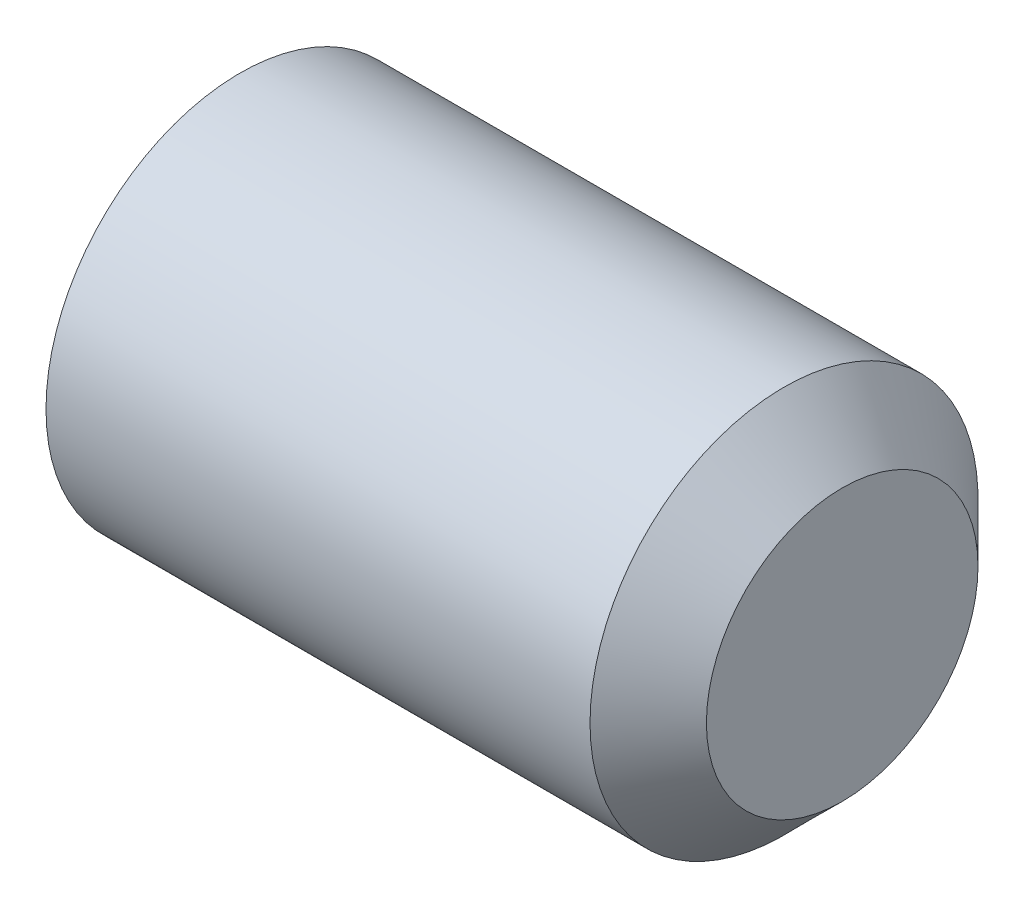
ISO-10303-21;
HEADER;
FILE_DESCRIPTION(('STEP AP214'),'2;1');
FILE_NAME('part.step','',(''),(''),'','','');
FILE_SCHEMA(('AUTOMOTIVE_DESIGN { 1 0 10303 214 1 1 1 1 }'));
ENDSEC;
DATA;
#1=APPLICATION_CONTEXT('core data for automotive mechanical design processes');
#2=APPLICATION_PROTOCOL_DEFINITION('international standard','automotive_design',2000,#1);
#3=PRODUCT_CONTEXT('',#1,'mechanical');
#4=PRODUCT('Part','Part','',(#3));
#5=PRODUCT_RELATED_PRODUCT_CATEGORY('part','',(#4));
#6=PRODUCT_DEFINITION_FORMATION('','',#4);
#7=PRODUCT_DEFINITION_CONTEXT('part definition',#1,'design');
#8=PRODUCT_DEFINITION('design','',#6,#7);
#9=PRODUCT_DEFINITION_SHAPE('','',#8);
#10=(LENGTH_UNIT() NAMED_UNIT(*) SI_UNIT(.MILLI.,.METRE.));
#11=(NAMED_UNIT(*) PLANE_ANGLE_UNIT() SI_UNIT($,.RADIAN.));
#12=(NAMED_UNIT(*) SI_UNIT($,.STERADIAN.) SOLID_ANGLE_UNIT());
#13=UNCERTAINTY_MEASURE_WITH_UNIT(LENGTH_MEASURE(1.E-05),#10,'distance_accuracy_value','');
#14=(GEOMETRIC_REPRESENTATION_CONTEXT(3) GLOBAL_UNCERTAINTY_ASSIGNED_CONTEXT((#13)) GLOBAL_UNIT_ASSIGNED_CONTEXT((#10,
#11,#12)) REPRESENTATION_CONTEXT('',''));
#15=CARTESIAN_POINT('',(0.,0.,0.));
#16=DIRECTION('',(0.,0.,1.));
#17=DIRECTION('',(1.,0.,0.));
#18=AXIS2_PLACEMENT_3D('',#15,#16,#17);
#19=CARTESIAN_POINT('',(0.,0.,0.));
#20=DIRECTION('',(-1.,0.,0.));
#21=DIRECTION('',(0.,0.,1.));
#22=AXIS2_PLACEMENT_3D('',#19,#20,#21);
#23=PLANE('',#22);
#24=CARTESIAN_POINT('',(0.,0.,0.));
#25=DIRECTION('',(-1.,0.,0.));
#26=DIRECTION('',(0.,0.,1.));
#27=AXIS2_PLACEMENT_3D('',#24,#25,#26);
#28=CIRCLE('',#27,4.172);
#29=CARTESIAN_POINT('',(0.,0.,4.172));
#30=VERTEX_POINT('',#29);
#31=EDGE_CURVE('E135',#30,#30,#28,.T.);
#32=ORIENTED_EDGE('',*,*,#31,.T.);
#33=EDGE_LOOP('',(#32));
#34=FACE_BOUND('',#33,.T.);
#35=DIRECTION('',(0.,0.,-1.));
#36=VECTOR('',#35,1.);
#37=CARTESIAN_POINT('',(0.,2.5,1.44337567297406));
#38=LINE('',#37,#36);
#39=CARTESIAN_POINT('',(0.,2.5,1.44337567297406));
#40=VERTEX_POINT('',#39);
#41=CARTESIAN_POINT('',(0.,2.5,-1.44337567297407));
#42=VERTEX_POINT('',#41);
#43=EDGE_CURVE('E126',#40,#42,#38,.T.);
#44=ORIENTED_EDGE('',*,*,#43,.F.);
#45=DIRECTION('',(0.,-0.866025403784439,0.5));
#46=VECTOR('',#45,1.);
#47=CARTESIAN_POINT('',(0.,2.5,1.44337567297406));
#48=LINE('',#47,#46);
#49=CARTESIAN_POINT('',(0.,0.,2.88675134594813));
#50=VERTEX_POINT('',#49);
#51=EDGE_CURVE('E48',#40,#50,#48,.T.);
#52=ORIENTED_EDGE('',*,*,#51,.T.);
#53=DIRECTION('',(0.,0.866025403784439,0.5));
#54=VECTOR('',#53,1.);
#55=CARTESIAN_POINT('',(0.,-2.5,1.44337567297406));
#56=LINE('',#55,#54);
#57=CARTESIAN_POINT('',(0.,-2.5,1.44337567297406));
#58=VERTEX_POINT('',#57);
#59=EDGE_CURVE('E117',#58,#50,#56,.T.);
#60=ORIENTED_EDGE('',*,*,#59,.F.);
#61=DIRECTION('',(0.,0.,-1.));
#62=VECTOR('',#61,1.);
#63=CARTESIAN_POINT('',(0.,-2.5,1.44337567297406));
#64=LINE('',#63,#62);
#65=CARTESIAN_POINT('',(0.,-2.5,-1.44337567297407));
#66=VERTEX_POINT('',#65);
#67=EDGE_CURVE('E120',#58,#66,#64,.T.);
#68=ORIENTED_EDGE('',*,*,#67,.T.);
#69=DIRECTION('',(0.,0.866025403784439,-0.5));
#70=VECTOR('',#69,1.);
#71=CARTESIAN_POINT('',(0.,-2.5,-1.44337567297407));
#72=LINE('',#71,#70);
#73=CARTESIAN_POINT('',(0.,0.,-2.88675134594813));
#74=VERTEX_POINT('',#73);
#75=EDGE_CURVE('E123',#66,#74,#72,.T.);
#76=ORIENTED_EDGE('',*,*,#75,.T.);
#77=DIRECTION('',(0.,-0.866025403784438,-0.5));
#78=VECTOR('',#77,1.);
#79=CARTESIAN_POINT('',(0.,2.5,-1.44337567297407));
#80=LINE('',#79,#78);
#81=EDGE_CURVE('E106',#42,#74,#80,.T.);
#82=ORIENTED_EDGE('',*,*,#81,.F.);
#83=EDGE_LOOP('',(#44,#52,#60,#68,#76,#82));
#84=FACE_BOUND('',#83,.T.);
#85=ADVANCED_FACE('F33',(#34,#84),#23,.T.);
#86=CARTESIAN_POINT('',(16.,3.5,0.));
#87=DIRECTION('',(1.,0.,0.));
#88=DIRECTION('',(0.,0.,-1.));
#89=AXIS2_PLACEMENT_3D('',#86,#87,#88);
#90=PLANE('',#89);
#91=CARTESIAN_POINT('',(16.,0.,0.));
#92=DIRECTION('',(-1.,0.,0.));
#93=DIRECTION('',(0.,0.,1.));
#94=AXIS2_PLACEMENT_3D('',#91,#92,#93);
#95=CIRCLE('',#94,3.5);
#96=CARTESIAN_POINT('',(16.,0.,3.5));
#97=VERTEX_POINT('',#96);
#98=EDGE_CURVE('E11',#97,#97,#95,.T.);
#99=ORIENTED_EDGE('',*,*,#98,.F.);
#100=EDGE_LOOP('',(#99));
#101=FACE_BOUND('',#100,.T.);
#102=ADVANCED_FACE('F35',(#101),#90,.T.);
#103=CARTESIAN_POINT('',(14.5,0.,0.));
#104=DIRECTION('',(-1.,0.,0.));
#105=DIRECTION('',(0.,0.,1.));
#106=AXIS2_PLACEMENT_3D('',#103,#104,#105);
#107=CONICAL_SURFACE('',#106,5.,0.785398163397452);
#108=ORIENTED_EDGE('',*,*,#98,.T.);
#109=EDGE_LOOP('',(#108));
#110=FACE_BOUND('',#109,.T.);
#111=CARTESIAN_POINT('',(14.5,0.,0.));
#112=DIRECTION('',(-1.,0.,0.));
#113=DIRECTION('',(0.,0.,1.));
#114=AXIS2_PLACEMENT_3D('',#111,#112,#113);
#115=CIRCLE('',#114,5.);
#116=CARTESIAN_POINT('',(14.5,0.,5.));
#117=VERTEX_POINT('',#116);
#118=EDGE_CURVE('E41',#117,#117,#115,.T.);
#119=ORIENTED_EDGE('',*,*,#118,.F.);
#120=EDGE_LOOP('',(#119));
#121=FACE_BOUND('',#120,.T.);
#122=ADVANCED_FACE('F146',(#110,#121),#107,.T.);
#123=CARTESIAN_POINT('',(-12.7,0.,0.));
#124=DIRECTION('',(-1.,0.,0.));
#125=DIRECTION('',(0.,0.,1.));
#126=AXIS2_PLACEMENT_3D('',#123,#124,#125);
#127=CYLINDRICAL_SURFACE('',#126,5.);
#128=ORIENTED_EDGE('',*,*,#118,.T.);
#129=EDGE_LOOP('',(#128));
#130=FACE_BOUND('',#129,.T.);
#131=CARTESIAN_POINT('',(0.478046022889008,0.,0.));
#132=DIRECTION('',(-1.,0.,0.));
#133=DIRECTION('',(0.,0.,1.));
#134=AXIS2_PLACEMENT_3D('',#131,#132,#133);
#135=CIRCLE('',#134,5.);
#136=CARTESIAN_POINT('',(0.478046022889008,0.,5.));
#137=VERTEX_POINT('',#136);
#138=EDGE_CURVE('E138',#137,#137,#135,.T.);
#139=ORIENTED_EDGE('',*,*,#138,.F.);
#140=EDGE_LOOP('',(#139));
#141=FACE_BOUND('',#140,.T.);
#142=ADVANCED_FACE('F143',(#130,#141),#127,.T.);
#143=CARTESIAN_POINT('',(0.,0.,0.));
#144=DIRECTION('',(1.,0.,0.));
#145=DIRECTION('',(0.,0.,-1.));
#146=AXIS2_PLACEMENT_3D('',#143,#144,#145);
#147=CONICAL_SURFACE('',#146,4.172,1.0471975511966);
#148=ORIENTED_EDGE('',*,*,#138,.T.);
#149=EDGE_LOOP('',(#148));
#150=FACE_BOUND('',#149,.T.);
#151=ORIENTED_EDGE('',*,*,#31,.F.);
#152=EDGE_LOOP('',(#151));
#153=FACE_BOUND('',#152,.T.);
#154=ADVANCED_FACE('F153',(#150,#153),#147,.T.);
#155=CARTESIAN_POINT('',(6.,2.5,1.44337567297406));
#156=DIRECTION('',(0.,-0.5,-0.866025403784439));
#157=DIRECTION('',(0.,0.866025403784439,-0.5));
#158=AXIS2_PLACEMENT_3D('',#155,#156,#157);
#159=PLANE('',#158);
#160=ORIENTED_EDGE('',*,*,#51,.F.);
#161=DIRECTION('',(-1.,0.,0.));
#162=VECTOR('',#161,1.);
#163=CARTESIAN_POINT('',(6.,2.5,1.44337567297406));
#164=LINE('',#163,#162);
#165=CARTESIAN_POINT('',(6.,2.5,1.44337567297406));
#166=VERTEX_POINT('',#165);
#167=EDGE_CURVE('E53',#166,#40,#164,.T.);
#168=ORIENTED_EDGE('',*,*,#167,.F.);
#169=DIRECTION('',(0.,-0.866025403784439,0.5));
#170=VECTOR('',#169,1.);
#171=CARTESIAN_POINT('',(6.,2.5,1.44337567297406));
#172=LINE('',#171,#170);
#173=CARTESIAN_POINT('',(6.,0.,2.88675134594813));
#174=VERTEX_POINT('',#173);
#175=EDGE_CURVE('E80',#166,#174,#172,.T.);
#176=ORIENTED_EDGE('',*,*,#175,.T.);
#177=DIRECTION('',(-1.,0.,0.));
#178=VECTOR('',#177,1.);
#179=CARTESIAN_POINT('',(6.,0.,2.88675134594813));
#180=LINE('',#179,#178);
#181=EDGE_CURVE('E133',#174,#50,#180,.T.);
#182=ORIENTED_EDGE('',*,*,#181,.T.);
#183=EDGE_LOOP('',(#160,#168,#176,#182));
#184=FACE_BOUND('',#183,.T.);
#185=ADVANCED_FACE('F164',(#184),#159,.T.);
#186=CARTESIAN_POINT('',(6.,-2.5,1.44337567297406));
#187=DIRECTION('',(0.,-0.5,0.866025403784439));
#188=DIRECTION('',(0.,-0.866025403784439,-0.5));
#189=AXIS2_PLACEMENT_3D('',#186,#187,#188);
#190=PLANE('',#189);
#191=ORIENTED_EDGE('',*,*,#59,.T.);
#192=ORIENTED_EDGE('',*,*,#181,.F.);
#193=DIRECTION('',(0.,0.866025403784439,0.5));
#194=VECTOR('',#193,1.);
#195=CARTESIAN_POINT('',(6.,-2.5,1.44337567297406));
#196=LINE('',#195,#194);
#197=CARTESIAN_POINT('',(6.,-2.5,1.44337567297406));
#198=VERTEX_POINT('',#197);
#199=EDGE_CURVE('E262',#198,#174,#196,.T.);
#200=ORIENTED_EDGE('',*,*,#199,.F.);
#201=DIRECTION('',(-1.,0.,0.));
#202=VECTOR('',#201,1.);
#203=CARTESIAN_POINT('',(6.,-2.5,1.44337567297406));
#204=LINE('',#203,#202);
#205=EDGE_CURVE('E131',#198,#58,#204,.T.);
#206=ORIENTED_EDGE('',*,*,#205,.T.);
#207=EDGE_LOOP('',(#191,#192,#200,#206));
#208=FACE_BOUND('',#207,.T.);
#209=ADVANCED_FACE('F171',(#208),#190,.F.);
#210=CARTESIAN_POINT('',(6.,-2.5,1.44337567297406));
#211=DIRECTION('',(0.,1.,0.));
#212=DIRECTION('',(0.,0.,1.));
#213=AXIS2_PLACEMENT_3D('',#210,#211,#212);
#214=PLANE('',#213);
#215=ORIENTED_EDGE('',*,*,#67,.F.);
#216=ORIENTED_EDGE('',*,*,#205,.F.);
#217=DIRECTION('',(0.,0.,-1.));
#218=VECTOR('',#217,1.);
#219=CARTESIAN_POINT('',(6.,-2.5,1.44337567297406));
#220=LINE('',#219,#218);
#221=CARTESIAN_POINT('',(6.,-2.5,-1.44337567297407));
#222=VERTEX_POINT('',#221);
#223=EDGE_CURVE('E101',#198,#222,#220,.T.);
#224=ORIENTED_EDGE('',*,*,#223,.T.);
#225=DIRECTION('',(-1.,0.,0.));
#226=VECTOR('',#225,1.);
#227=CARTESIAN_POINT('',(6.,-2.5,-1.44337567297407));
#228=LINE('',#227,#226);
#229=EDGE_CURVE('E96',#222,#66,#228,.T.);
#230=ORIENTED_EDGE('',*,*,#229,.T.);
#231=EDGE_LOOP('',(#215,#216,#224,#230));
#232=FACE_BOUND('',#231,.T.);
#233=ADVANCED_FACE('F178',(#232),#214,.T.);
#234=CARTESIAN_POINT('',(6.,-2.5,-1.44337567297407));
#235=DIRECTION('',(0.,0.5,0.866025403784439));
#236=DIRECTION('',(0.,-0.866025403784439,0.5));
#237=AXIS2_PLACEMENT_3D('',#234,#235,#236);
#238=PLANE('',#237);
#239=ORIENTED_EDGE('',*,*,#75,.F.);
#240=ORIENTED_EDGE('',*,*,#229,.F.);
#241=DIRECTION('',(0.,0.866025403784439,-0.5));
#242=VECTOR('',#241,1.);
#243=CARTESIAN_POINT('',(6.,-2.5,-1.44337567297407));
#244=LINE('',#243,#242);
#245=CARTESIAN_POINT('',(6.,0.,-2.88675134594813));
#246=VERTEX_POINT('',#245);
#247=EDGE_CURVE('E91',#222,#246,#244,.T.);
#248=ORIENTED_EDGE('',*,*,#247,.T.);
#249=DIRECTION('',(-1.,0.,0.));
#250=VECTOR('',#249,1.);
#251=CARTESIAN_POINT('',(6.,0.,-2.88675134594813));
#252=LINE('',#251,#250);
#253=EDGE_CURVE('E95',#246,#74,#252,.T.);
#254=ORIENTED_EDGE('',*,*,#253,.T.);
#255=EDGE_LOOP('',(#239,#240,#248,#254));
#256=FACE_BOUND('',#255,.T.);
#257=ADVANCED_FACE('F94',(#256),#238,.T.);
#258=CARTESIAN_POINT('',(6.,2.5,-1.44337567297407));
#259=DIRECTION('',(0.,0.5,-0.866025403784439));
#260=DIRECTION('',(0.,0.866025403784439,0.5));
#261=AXIS2_PLACEMENT_3D('',#258,#259,#260);
#262=PLANE('',#261);
#263=ORIENTED_EDGE('',*,*,#81,.T.);
#264=ORIENTED_EDGE('',*,*,#253,.F.);
#265=DIRECTION('',(0.,-0.866025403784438,-0.5));
#266=VECTOR('',#265,1.);
#267=CARTESIAN_POINT('',(6.,2.5,-1.44337567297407));
#268=LINE('',#267,#266);
#269=CARTESIAN_POINT('',(6.,2.5,-1.44337567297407));
#270=VERTEX_POINT('',#269);
#271=EDGE_CURVE('E100',#270,#246,#268,.T.);
#272=ORIENTED_EDGE('',*,*,#271,.F.);
#273=DIRECTION('',(-1.,0.,0.));
#274=VECTOR('',#273,1.);
#275=CARTESIAN_POINT('',(6.,2.5,-1.44337567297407));
#276=LINE('',#275,#274);
#277=EDGE_CURVE('E76',#270,#42,#276,.T.);
#278=ORIENTED_EDGE('',*,*,#277,.T.);
#279=EDGE_LOOP('',(#263,#264,#272,#278));
#280=FACE_BOUND('',#279,.T.);
#281=ADVANCED_FACE('F103',(#280),#262,.F.);
#282=CARTESIAN_POINT('',(6.,2.5,1.44337567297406));
#283=DIRECTION('',(0.,1.,0.));
#284=DIRECTION('',(0.,0.,1.));
#285=AXIS2_PLACEMENT_3D('',#282,#283,#284);
#286=PLANE('',#285);
#287=ORIENTED_EDGE('',*,*,#43,.T.);
#288=ORIENTED_EDGE('',*,*,#277,.F.);
#289=DIRECTION('',(0.,0.,-1.));
#290=VECTOR('',#289,1.);
#291=CARTESIAN_POINT('',(6.,2.5,1.44337567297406));
#292=LINE('',#291,#290);
#293=EDGE_CURVE('E111',#166,#270,#292,.T.);
#294=ORIENTED_EDGE('',*,*,#293,.F.);
#295=ORIENTED_EDGE('',*,*,#167,.T.);
#296=EDGE_LOOP('',(#287,#288,#294,#295));
#297=FACE_BOUND('',#296,.T.);
#298=ADVANCED_FACE('F190',(#297),#286,.F.);
#299=CARTESIAN_POINT('',(6.,2.5,1.44337567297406));
#300=DIRECTION('',(1.,0.,0.));
#301=DIRECTION('',(0.,0.,-1.));
#302=AXIS2_PLACEMENT_3D('',#299,#300,#301);
#303=PLANE('',#302);
#304=ORIENTED_EDGE('',*,*,#175,.F.);
#305=ORIENTED_EDGE('',*,*,#293,.T.);
#306=ORIENTED_EDGE('',*,*,#271,.T.);
#307=ORIENTED_EDGE('',*,*,#247,.F.);
#308=ORIENTED_EDGE('',*,*,#223,.F.);
#309=ORIENTED_EDGE('',*,*,#199,.T.);
#310=EDGE_LOOP('',(#304,#305,#306,#307,#308,#309));
#311=FACE_BOUND('',#310,.T.);
#312=ADVANCED_FACE('F109',(#311),#303,.F.);
#313=CLOSED_SHELL('',(#85,#102,#122,#142,#154,#185,#209,#233,#257,#281,#298,#312));
#314=MANIFOLD_SOLID_BREP('B2',#313);
#315=ADVANCED_BREP_SHAPE_REPRESENTATION('',(#18,#314),#14);
#316=SHAPE_DEFINITION_REPRESENTATION(#9,#315);
ENDSEC;
END-ISO-10303-21;
